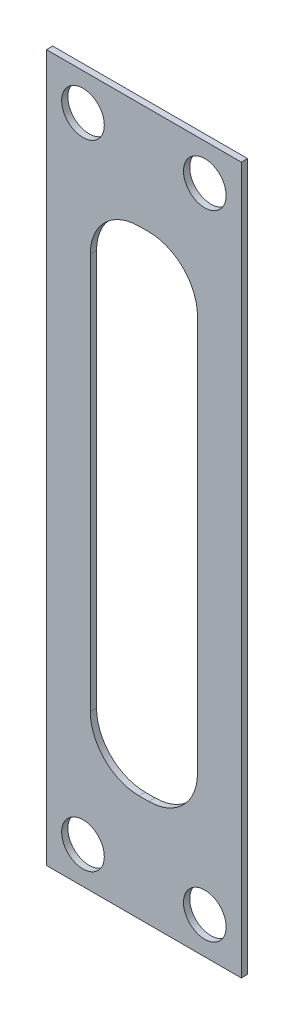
ISO-10303-21;
HEADER;
FILE_DESCRIPTION(('STEP AP214'),'2;1');
FILE_NAME('part.step','',(''),(''),'','','');
FILE_SCHEMA(('AUTOMOTIVE_DESIGN { 1 0 10303 214 1 1 1 1 }'));
ENDSEC;
DATA;
#1=APPLICATION_CONTEXT('core data for automotive mechanical design processes');
#2=APPLICATION_PROTOCOL_DEFINITION('international standard','automotive_design',2000,#1);
#3=PRODUCT_CONTEXT('',#1,'mechanical');
#4=PRODUCT('Part','Part','',(#3));
#5=PRODUCT_RELATED_PRODUCT_CATEGORY('part','',(#4));
#6=PRODUCT_DEFINITION_FORMATION('','',#4);
#7=PRODUCT_DEFINITION_CONTEXT('part definition',#1,'design');
#8=PRODUCT_DEFINITION('design','',#6,#7);
#9=PRODUCT_DEFINITION_SHAPE('','',#8);
#10=(LENGTH_UNIT() NAMED_UNIT(*) SI_UNIT(.MILLI.,.METRE.));
#11=(NAMED_UNIT(*) PLANE_ANGLE_UNIT() SI_UNIT($,.RADIAN.));
#12=(NAMED_UNIT(*) SI_UNIT($,.STERADIAN.) SOLID_ANGLE_UNIT());
#13=UNCERTAINTY_MEASURE_WITH_UNIT(LENGTH_MEASURE(1.E-05),#10,'distance_accuracy_value','');
#14=(GEOMETRIC_REPRESENTATION_CONTEXT(3) GLOBAL_UNCERTAINTY_ASSIGNED_CONTEXT((#13)) GLOBAL_UNIT_ASSIGNED_CONTEXT((#10,
#11,#12)) REPRESENTATION_CONTEXT('',''));
#15=CARTESIAN_POINT('',(0.,0.,0.));
#16=DIRECTION('',(0.,0.,1.));
#17=DIRECTION('',(1.,0.,0.));
#18=AXIS2_PLACEMENT_3D('',#15,#16,#17);
#19=CARTESIAN_POINT('',(-12.7,-46.0375,0.406400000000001));
#20=DIRECTION('',(0.,0.,1.));
#21=DIRECTION('',(1.,0.,0.));
#22=AXIS2_PLACEMENT_3D('',#19,#20,#21);
#23=PLANE('',#22);
#24=CARTESIAN_POINT('',(-7.93750000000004,41.275,0.406400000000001));
#25=DIRECTION('',(0.,0.,1.));
#26=DIRECTION('',(1.,0.,0.));
#27=AXIS2_PLACEMENT_3D('',#24,#25,#26);
#28=CIRCLE('',#27,2.778125);
#29=CARTESIAN_POINT('',(-5.15937500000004,41.275,0.406400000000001));
#30=VERTEX_POINT('',#29);
#31=EDGE_CURVE('E312',#30,#30,#28,.T.);
#32=ORIENTED_EDGE('',*,*,#31,.F.);
#33=EDGE_LOOP('',(#32));
#34=FACE_BOUND('',#33,.T.);
#35=CARTESIAN_POINT('',(7.93750000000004,41.275,0.406400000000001));
#36=DIRECTION('',(0.,0.,1.));
#37=DIRECTION('',(1.,0.,0.));
#38=AXIS2_PLACEMENT_3D('',#35,#36,#37);
#39=CIRCLE('',#38,2.778125);
#40=CARTESIAN_POINT('',(10.715625,41.275,0.406400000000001));
#41=VERTEX_POINT('',#40);
#42=EDGE_CURVE('E316',#41,#41,#39,.T.);
#43=ORIENTED_EDGE('',*,*,#42,.F.);
#44=EDGE_LOOP('',(#43));
#45=FACE_BOUND('',#44,.T.);
#46=CARTESIAN_POINT('',(7.93750000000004,-41.275,0.406400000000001));
#47=DIRECTION('',(0.,0.,1.));
#48=DIRECTION('',(1.,0.,0.));
#49=AXIS2_PLACEMENT_3D('',#46,#47,#48);
#50=CIRCLE('',#49,2.778125);
#51=CARTESIAN_POINT('',(10.715625,-41.275,0.406400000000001));
#52=VERTEX_POINT('',#51);
#53=EDGE_CURVE('E325',#52,#52,#50,.T.);
#54=ORIENTED_EDGE('',*,*,#53,.F.);
#55=EDGE_LOOP('',(#54));
#56=FACE_BOUND('',#55,.T.);
#57=CARTESIAN_POINT('',(-7.93750000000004,-41.275,0.406400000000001));
#58=DIRECTION('',(0.,0.,1.));
#59=DIRECTION('',(1.,0.,0.));
#60=AXIS2_PLACEMENT_3D('',#57,#58,#59);
#61=CIRCLE('',#60,2.778125);
#62=CARTESIAN_POINT('',(-5.15937500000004,-41.275,0.406400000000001));
#63=VERTEX_POINT('',#62);
#64=EDGE_CURVE('E164',#63,#63,#61,.T.);
#65=ORIENTED_EDGE('',*,*,#64,.F.);
#66=EDGE_LOOP('',(#65));
#67=FACE_BOUND('',#66,.T.);
#68=DIRECTION('',(0.,-1.,0.));
#69=VECTOR('',#68,1.);
#70=CARTESIAN_POINT('',(-12.7,46.0375,0.406400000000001));
#71=LINE('',#70,#69);
#72=CARTESIAN_POINT('',(-12.7,46.0375,0.406400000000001));
#73=VERTEX_POINT('',#72);
#74=CARTESIAN_POINT('',(-12.7,-46.0375,0.406400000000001));
#75=VERTEX_POINT('',#74);
#76=EDGE_CURVE('E194',#73,#75,#71,.T.);
#77=ORIENTED_EDGE('',*,*,#76,.T.);
#78=DIRECTION('',(1.,0.,0.));
#79=VECTOR('',#78,1.);
#80=CARTESIAN_POINT('',(-12.7,-46.0375,0.406400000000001));
#81=LINE('',#80,#79);
#82=CARTESIAN_POINT('',(12.7,-46.0375,0.406400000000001));
#83=VERTEX_POINT('',#82);
#84=EDGE_CURVE('E197',#75,#83,#81,.T.);
#85=ORIENTED_EDGE('',*,*,#84,.T.);
#86=DIRECTION('',(0.,1.,0.));
#87=VECTOR('',#86,1.);
#88=CARTESIAN_POINT('',(12.7,46.0375,0.406400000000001));
#89=LINE('',#88,#87);
#90=CARTESIAN_POINT('',(12.7,46.0375,0.406400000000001));
#91=VERTEX_POINT('',#90);
#92=EDGE_CURVE('E200',#83,#91,#89,.T.);
#93=ORIENTED_EDGE('',*,*,#92,.T.);
#94=DIRECTION('',(-1.,0.,0.));
#95=VECTOR('',#94,1.);
#96=CARTESIAN_POINT('',(-12.7,46.0375,0.406400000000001));
#97=LINE('',#96,#95);
#98=EDGE_CURVE('E202',#91,#73,#97,.T.);
#99=ORIENTED_EDGE('',*,*,#98,.T.);
#100=EDGE_LOOP('',(#77,#85,#93,#99));
#101=FACE_BOUND('',#100,.T.);
#102=DIRECTION('',(0.,-1.,0.));
#103=VECTOR('',#102,1.);
#104=CARTESIAN_POINT('',(-6.98500000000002,25.7937,0.406400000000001));
#105=LINE('',#104,#103);
#106=CARTESIAN_POINT('',(-6.98500000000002,25.7937,0.406400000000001));
#107=VERTEX_POINT('',#106);
#108=CARTESIAN_POINT('',(-6.98500000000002,-25.7937,0.406400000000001));
#109=VERTEX_POINT('',#108);
#110=EDGE_CURVE('E135',#107,#109,#105,.T.);
#111=ORIENTED_EDGE('',*,*,#110,.F.);
#112=CARTESIAN_POINT('',(-0.635000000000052,25.7937,0.406400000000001));
#113=DIRECTION('',(0.,0.,1.));
#114=DIRECTION('',(-1.,0.,0.));
#115=AXIS2_PLACEMENT_3D('',#112,#113,#114);
#116=CIRCLE('',#115,6.35);
#117=CARTESIAN_POINT('',(-0.635000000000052,32.1437,0.406400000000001));
#118=VERTEX_POINT('',#117);
#119=EDGE_CURVE('E127',#118,#107,#116,.T.);
#120=ORIENTED_EDGE('',*,*,#119,.F.);
#121=DIRECTION('',(-1.,0.,0.));
#122=VECTOR('',#121,1.);
#123=CARTESIAN_POINT('',(-0.635000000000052,32.1437,0.406400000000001));
#124=LINE('',#123,#122);
#125=CARTESIAN_POINT('',(0.635000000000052,32.1437,0.406400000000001));
#126=VERTEX_POINT('',#125);
#127=EDGE_CURVE('E161',#126,#118,#124,.T.);
#128=ORIENTED_EDGE('',*,*,#127,.F.);
#129=CARTESIAN_POINT('',(0.635000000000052,25.7937,0.406400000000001));
#130=DIRECTION('',(0.,0.,1.));
#131=DIRECTION('',(1.,0.,0.));
#132=AXIS2_PLACEMENT_3D('',#129,#130,#131);
#133=CIRCLE('',#132,6.35);
#134=CARTESIAN_POINT('',(6.98500000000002,25.7937,0.406400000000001));
#135=VERTEX_POINT('',#134);
#136=EDGE_CURVE('E159',#135,#126,#133,.T.);
#137=ORIENTED_EDGE('',*,*,#136,.F.);
#138=DIRECTION('',(0.,1.,0.));
#139=VECTOR('',#138,1.);
#140=CARTESIAN_POINT('',(6.98500000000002,25.7937,0.406400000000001));
#141=LINE('',#140,#139);
#142=CARTESIAN_POINT('',(6.98500000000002,-25.7937,0.406400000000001));
#143=VERTEX_POINT('',#142);
#144=EDGE_CURVE('E157',#143,#135,#141,.T.);
#145=ORIENTED_EDGE('',*,*,#144,.F.);
#146=CARTESIAN_POINT('',(0.635000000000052,-25.7937,0.406400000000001));
#147=DIRECTION('',(0.,0.,1.));
#148=DIRECTION('',(1.,0.,0.));
#149=AXIS2_PLACEMENT_3D('',#146,#147,#148);
#150=CIRCLE('',#149,6.35);
#151=CARTESIAN_POINT('',(0.635000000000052,-32.1437,0.406400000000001));
#152=VERTEX_POINT('',#151);
#153=EDGE_CURVE('E155',#152,#143,#150,.T.);
#154=ORIENTED_EDGE('',*,*,#153,.F.);
#155=DIRECTION('',(1.,0.,0.));
#156=VECTOR('',#155,1.);
#157=CARTESIAN_POINT('',(-0.634999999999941,-32.1437,0.406400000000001));
#158=LINE('',#157,#156);
#159=CARTESIAN_POINT('',(-0.635000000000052,-32.1437,0.406400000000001));
#160=VERTEX_POINT('',#159);
#161=EDGE_CURVE('E150',#160,#152,#158,.T.);
#162=ORIENTED_EDGE('',*,*,#161,.F.);
#163=CARTESIAN_POINT('',(-0.635000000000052,-25.7937,0.406400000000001));
#164=DIRECTION('',(0.,0.,1.));
#165=DIRECTION('',(1.,0.,0.));
#166=AXIS2_PLACEMENT_3D('',#163,#164,#165);
#167=CIRCLE('',#166,6.35);
#168=EDGE_CURVE('E148',#109,#160,#167,.T.);
#169=ORIENTED_EDGE('',*,*,#168,.F.);
#170=EDGE_LOOP('',(#111,#120,#128,#137,#145,#154,#162,#169));
#171=FACE_BOUND('',#170,.T.);
#172=ADVANCED_FACE('F38',(#34,#45,#56,#67,#101,#171),#23,.T.);
#173=CARTESIAN_POINT('',(-12.7,-46.0375,-0.406400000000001));
#174=DIRECTION('',(0.,0.,1.));
#175=DIRECTION('',(1.,0.,0.));
#176=AXIS2_PLACEMENT_3D('',#173,#174,#175);
#177=PLANE('',#176);
#178=CARTESIAN_POINT('',(-7.93750000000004,41.275,-0.406400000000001));
#179=DIRECTION('',(0.,0.,1.));
#180=DIRECTION('',(1.,0.,0.));
#181=AXIS2_PLACEMENT_3D('',#178,#179,#180);
#182=CIRCLE('',#181,2.778125);
#183=CARTESIAN_POINT('',(-5.15937500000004,41.275,-0.406400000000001));
#184=VERTEX_POINT('',#183);
#185=EDGE_CURVE('E310',#184,#184,#182,.T.);
#186=ORIENTED_EDGE('',*,*,#185,.T.);
#187=EDGE_LOOP('',(#186));
#188=FACE_BOUND('',#187,.T.);
#189=CARTESIAN_POINT('',(7.93750000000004,41.275,-0.406400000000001));
#190=DIRECTION('',(0.,0.,1.));
#191=DIRECTION('',(1.,0.,0.));
#192=AXIS2_PLACEMENT_3D('',#189,#190,#191);
#193=CIRCLE('',#192,2.778125);
#194=CARTESIAN_POINT('',(10.715625,41.275,-0.406400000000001));
#195=VERTEX_POINT('',#194);
#196=EDGE_CURVE('E313',#195,#195,#193,.T.);
#197=ORIENTED_EDGE('',*,*,#196,.T.);
#198=EDGE_LOOP('',(#197));
#199=FACE_BOUND('',#198,.T.);
#200=CARTESIAN_POINT('',(7.93750000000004,-41.275,-0.406400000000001));
#201=DIRECTION('',(0.,0.,1.));
#202=DIRECTION('',(1.,0.,0.));
#203=AXIS2_PLACEMENT_3D('',#200,#201,#202);
#204=CIRCLE('',#203,2.778125);
#205=CARTESIAN_POINT('',(10.715625,-41.275,-0.406400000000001));
#206=VERTEX_POINT('',#205);
#207=EDGE_CURVE('E322',#206,#206,#204,.T.);
#208=ORIENTED_EDGE('',*,*,#207,.T.);
#209=EDGE_LOOP('',(#208));
#210=FACE_BOUND('',#209,.T.);
#211=CARTESIAN_POINT('',(-7.93750000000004,-41.275,-0.406400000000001));
#212=DIRECTION('',(0.,0.,1.));
#213=DIRECTION('',(1.,0.,0.));
#214=AXIS2_PLACEMENT_3D('',#211,#212,#213);
#215=CIRCLE('',#214,2.778125);
#216=CARTESIAN_POINT('',(-5.15937500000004,-41.275,-0.406400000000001));
#217=VERTEX_POINT('',#216);
#218=EDGE_CURVE('E328',#217,#217,#215,.T.);
#219=ORIENTED_EDGE('',*,*,#218,.T.);
#220=EDGE_LOOP('',(#219));
#221=FACE_BOUND('',#220,.T.);
#222=DIRECTION('',(0.,-1.,0.));
#223=VECTOR('',#222,1.);
#224=CARTESIAN_POINT('',(-12.7,46.0375,-0.406400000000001));
#225=LINE('',#224,#223);
#226=CARTESIAN_POINT('',(-12.7,46.0375,-0.406400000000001));
#227=VERTEX_POINT('',#226);
#228=CARTESIAN_POINT('',(-12.7,-46.0375,-0.406400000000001));
#229=VERTEX_POINT('',#228);
#230=EDGE_CURVE('E143',#227,#229,#225,.T.);
#231=ORIENTED_EDGE('',*,*,#230,.F.);
#232=DIRECTION('',(-1.,0.,0.));
#233=VECTOR('',#232,1.);
#234=CARTESIAN_POINT('',(-12.7,46.0375,-0.406400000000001));
#235=LINE('',#234,#233);
#236=CARTESIAN_POINT('',(12.7,46.0375,-0.406400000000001));
#237=VERTEX_POINT('',#236);
#238=EDGE_CURVE('E198',#237,#227,#235,.T.);
#239=ORIENTED_EDGE('',*,*,#238,.F.);
#240=DIRECTION('',(0.,1.,0.));
#241=VECTOR('',#240,1.);
#242=CARTESIAN_POINT('',(12.7,46.0375,-0.406400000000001));
#243=LINE('',#242,#241);
#244=CARTESIAN_POINT('',(12.7,-46.0375,-0.406400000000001));
#245=VERTEX_POINT('',#244);
#246=EDGE_CURVE('E209',#245,#237,#243,.T.);
#247=ORIENTED_EDGE('',*,*,#246,.F.);
#248=DIRECTION('',(1.,0.,0.));
#249=VECTOR('',#248,1.);
#250=CARTESIAN_POINT('',(-12.7,-46.0375,-0.406400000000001));
#251=LINE('',#250,#249);
#252=EDGE_CURVE('E207',#229,#245,#251,.T.);
#253=ORIENTED_EDGE('',*,*,#252,.F.);
#254=EDGE_LOOP('',(#231,#239,#247,#253));
#255=FACE_BOUND('',#254,.T.);
#256=CARTESIAN_POINT('',(-0.635000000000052,25.7937,-0.406400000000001));
#257=DIRECTION('',(0.,0.,1.));
#258=DIRECTION('',(-1.,0.,0.));
#259=AXIS2_PLACEMENT_3D('',#256,#257,#258);
#260=CIRCLE('',#259,6.35);
#261=CARTESIAN_POINT('',(-0.635000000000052,32.1437,-0.406400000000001));
#262=VERTEX_POINT('',#261);
#263=CARTESIAN_POINT('',(-6.98500000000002,25.7937,-0.406400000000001));
#264=VERTEX_POINT('',#263);
#265=EDGE_CURVE('E61',#262,#264,#260,.T.);
#266=ORIENTED_EDGE('',*,*,#265,.T.);
#267=DIRECTION('',(0.,-1.,0.));
#268=VECTOR('',#267,1.);
#269=CARTESIAN_POINT('',(-6.98500000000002,25.7937,-0.406400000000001));
#270=LINE('',#269,#268);
#271=CARTESIAN_POINT('',(-6.98500000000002,-25.7937,-0.406400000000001));
#272=VERTEX_POINT('',#271);
#273=EDGE_CURVE('E142',#264,#272,#270,.T.);
#274=ORIENTED_EDGE('',*,*,#273,.T.);
#275=CARTESIAN_POINT('',(-0.635000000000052,-25.7937,-0.406400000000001));
#276=DIRECTION('',(0.,0.,1.));
#277=DIRECTION('',(1.,0.,0.));
#278=AXIS2_PLACEMENT_3D('',#275,#276,#277);
#279=CIRCLE('',#278,6.35);
#280=CARTESIAN_POINT('',(-0.635000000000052,-32.1437,-0.406400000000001));
#281=VERTEX_POINT('',#280);
#282=EDGE_CURVE('E166',#272,#281,#279,.T.);
#283=ORIENTED_EDGE('',*,*,#282,.T.);
#284=DIRECTION('',(1.,0.,0.));
#285=VECTOR('',#284,1.);
#286=CARTESIAN_POINT('',(-0.634999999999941,-32.1437,-0.406400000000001));
#287=LINE('',#286,#285);
#288=CARTESIAN_POINT('',(0.635000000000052,-32.1437,-0.406400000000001));
#289=VERTEX_POINT('',#288);
#290=EDGE_CURVE('E169',#281,#289,#287,.T.);
#291=ORIENTED_EDGE('',*,*,#290,.T.);
#292=CARTESIAN_POINT('',(0.635000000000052,-25.7937,-0.406400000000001));
#293=DIRECTION('',(0.,0.,1.));
#294=DIRECTION('',(1.,0.,0.));
#295=AXIS2_PLACEMENT_3D('',#292,#293,#294);
#296=CIRCLE('',#295,6.35);
#297=CARTESIAN_POINT('',(6.98500000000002,-25.7937,-0.406400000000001));
#298=VERTEX_POINT('',#297);
#299=EDGE_CURVE('E172',#289,#298,#296,.T.);
#300=ORIENTED_EDGE('',*,*,#299,.T.);
#301=DIRECTION('',(0.,1.,0.));
#302=VECTOR('',#301,1.);
#303=CARTESIAN_POINT('',(6.98500000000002,25.7937,-0.406400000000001));
#304=LINE('',#303,#302);
#305=CARTESIAN_POINT('',(6.98500000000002,25.7937,-0.406400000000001));
#306=VERTEX_POINT('',#305);
#307=EDGE_CURVE('E175',#298,#306,#304,.T.);
#308=ORIENTED_EDGE('',*,*,#307,.T.);
#309=CARTESIAN_POINT('',(0.635000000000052,25.7937,-0.406400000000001));
#310=DIRECTION('',(0.,0.,1.));
#311=DIRECTION('',(1.,0.,0.));
#312=AXIS2_PLACEMENT_3D('',#309,#310,#311);
#313=CIRCLE('',#312,6.35);
#314=CARTESIAN_POINT('',(0.635000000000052,32.1437,-0.406400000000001));
#315=VERTEX_POINT('',#314);
#316=EDGE_CURVE('E178',#306,#315,#313,.T.);
#317=ORIENTED_EDGE('',*,*,#316,.T.);
#318=DIRECTION('',(-1.,0.,0.));
#319=VECTOR('',#318,1.);
#320=CARTESIAN_POINT('',(-0.635000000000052,32.1437,-0.406400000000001));
#321=LINE('',#320,#319);
#322=EDGE_CURVE('E136',#315,#262,#321,.T.);
#323=ORIENTED_EDGE('',*,*,#322,.T.);
#324=EDGE_LOOP('',(#266,#274,#283,#291,#300,#308,#317,#323));
#325=FACE_BOUND('',#324,.T.);
#326=ADVANCED_FACE('F227',(#188,#199,#210,#221,#255,#325),#177,.F.);
#327=CARTESIAN_POINT('',(-12.7,46.0375,0.406400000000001));
#328=DIRECTION('',(1.,0.,0.));
#329=DIRECTION('',(0.,1.,0.));
#330=AXIS2_PLACEMENT_3D('',#327,#328,#329);
#331=PLANE('',#330);
#332=ORIENTED_EDGE('',*,*,#230,.T.);
#333=DIRECTION('',(0.,0.,-1.));
#334=VECTOR('',#333,1.);
#335=CARTESIAN_POINT('',(-12.7,-46.0375,0.406400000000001));
#336=LINE('',#335,#334);
#337=EDGE_CURVE('E11',#75,#229,#336,.T.);
#338=ORIENTED_EDGE('',*,*,#337,.F.);
#339=ORIENTED_EDGE('',*,*,#76,.F.);
#340=DIRECTION('',(0.,0.,-1.));
#341=VECTOR('',#340,1.);
#342=CARTESIAN_POINT('',(-12.7,46.0375,0.406400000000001));
#343=LINE('',#342,#341);
#344=EDGE_CURVE('E204',#73,#227,#343,.T.);
#345=ORIENTED_EDGE('',*,*,#344,.T.);
#346=EDGE_LOOP('',(#332,#338,#339,#345));
#347=FACE_BOUND('',#346,.T.);
#348=ADVANCED_FACE('F40',(#347),#331,.F.);
#349=CARTESIAN_POINT('',(-12.7,-46.0375,0.406400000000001));
#350=DIRECTION('',(0.,1.,0.));
#351=DIRECTION('',(0.,0.,1.));
#352=AXIS2_PLACEMENT_3D('',#349,#350,#351);
#353=PLANE('',#352);
#354=ORIENTED_EDGE('',*,*,#252,.T.);
#355=DIRECTION('',(0.,0.,-1.));
#356=VECTOR('',#355,1.);
#357=CARTESIAN_POINT('',(12.7,-46.0375,0.406400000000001));
#358=LINE('',#357,#356);
#359=EDGE_CURVE('E46',#83,#245,#358,.T.);
#360=ORIENTED_EDGE('',*,*,#359,.F.);
#361=ORIENTED_EDGE('',*,*,#84,.F.);
#362=ORIENTED_EDGE('',*,*,#337,.T.);
#363=EDGE_LOOP('',(#354,#360,#361,#362));
#364=FACE_BOUND('',#363,.T.);
#365=ADVANCED_FACE('F237',(#364),#353,.F.);
#366=CARTESIAN_POINT('',(12.7,46.0375,0.406400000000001));
#367=DIRECTION('',(-1.,0.,0.));
#368=DIRECTION('',(0.,-1.,0.));
#369=AXIS2_PLACEMENT_3D('',#366,#367,#368);
#370=PLANE('',#369);
#371=ORIENTED_EDGE('',*,*,#246,.T.);
#372=DIRECTION('',(0.,0.,-1.));
#373=VECTOR('',#372,1.);
#374=CARTESIAN_POINT('',(12.7,46.0375,0.406400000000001));
#375=LINE('',#374,#373);
#376=EDGE_CURVE('E214',#91,#237,#375,.T.);
#377=ORIENTED_EDGE('',*,*,#376,.F.);
#378=ORIENTED_EDGE('',*,*,#92,.F.);
#379=ORIENTED_EDGE('',*,*,#359,.T.);
#380=EDGE_LOOP('',(#371,#377,#378,#379));
#381=FACE_BOUND('',#380,.T.);
#382=ADVANCED_FACE('F221',(#381),#370,.F.);
#383=CARTESIAN_POINT('',(-12.7,46.0375,0.406400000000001));
#384=DIRECTION('',(0.,-1.,0.));
#385=DIRECTION('',(0.,0.,-1.));
#386=AXIS2_PLACEMENT_3D('',#383,#384,#385);
#387=PLANE('',#386);
#388=ORIENTED_EDGE('',*,*,#238,.T.);
#389=ORIENTED_EDGE('',*,*,#344,.F.);
#390=ORIENTED_EDGE('',*,*,#98,.F.);
#391=ORIENTED_EDGE('',*,*,#376,.T.);
#392=EDGE_LOOP('',(#388,#389,#390,#391));
#393=FACE_BOUND('',#392,.T.);
#394=ADVANCED_FACE('F231',(#393),#387,.F.);
#395=CARTESIAN_POINT('',(-0.635000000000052,25.7937,0.406400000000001));
#396=DIRECTION('',(0.,0.,-1.));
#397=DIRECTION('',(-1.,0.,0.));
#398=AXIS2_PLACEMENT_3D('',#395,#396,#397);
#399=CYLINDRICAL_SURFACE('',#398,6.35);
#400=ORIENTED_EDGE('',*,*,#265,.F.);
#401=DIRECTION('',(0.,0.,-1.));
#402=VECTOR('',#401,1.);
#403=CARTESIAN_POINT('',(-0.635000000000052,32.1437,0.406400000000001));
#404=LINE('',#403,#402);
#405=EDGE_CURVE('E131',#118,#262,#404,.T.);
#406=ORIENTED_EDGE('',*,*,#405,.F.);
#407=ORIENTED_EDGE('',*,*,#119,.T.);
#408=DIRECTION('',(0.,0.,-1.));
#409=VECTOR('',#408,1.);
#410=CARTESIAN_POINT('',(-6.98500000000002,25.7937,0.406400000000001));
#411=LINE('',#410,#409);
#412=EDGE_CURVE('E130',#107,#264,#411,.T.);
#413=ORIENTED_EDGE('',*,*,#412,.T.);
#414=EDGE_LOOP('',(#400,#406,#407,#413));
#415=FACE_BOUND('',#414,.T.);
#416=ADVANCED_FACE('F129',(#415),#399,.F.);
#417=CARTESIAN_POINT('',(-6.98500000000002,25.7937,0.406400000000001));
#418=DIRECTION('',(1.,0.,0.));
#419=DIRECTION('',(0.,1.,0.));
#420=AXIS2_PLACEMENT_3D('',#417,#418,#419);
#421=PLANE('',#420);
#422=ORIENTED_EDGE('',*,*,#273,.F.);
#423=ORIENTED_EDGE('',*,*,#412,.F.);
#424=ORIENTED_EDGE('',*,*,#110,.T.);
#425=DIRECTION('',(0.,0.,-1.));
#426=VECTOR('',#425,1.);
#427=CARTESIAN_POINT('',(-6.98500000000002,-25.7937,0.406400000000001));
#428=LINE('',#427,#426);
#429=EDGE_CURVE('E144',#109,#272,#428,.T.);
#430=ORIENTED_EDGE('',*,*,#429,.T.);
#431=EDGE_LOOP('',(#422,#423,#424,#430));
#432=FACE_BOUND('',#431,.T.);
#433=ADVANCED_FACE('F139',(#432),#421,.T.);
#434=CARTESIAN_POINT('',(-0.635000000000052,-25.7937,0.406400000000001));
#435=DIRECTION('',(0.,0.,-1.));
#436=DIRECTION('',(-1.,0.,0.));
#437=AXIS2_PLACEMENT_3D('',#434,#435,#436);
#438=CYLINDRICAL_SURFACE('',#437,6.35);
#439=ORIENTED_EDGE('',*,*,#282,.F.);
#440=ORIENTED_EDGE('',*,*,#429,.F.);
#441=ORIENTED_EDGE('',*,*,#168,.T.);
#442=DIRECTION('',(0.,0.,-1.));
#443=VECTOR('',#442,1.);
#444=CARTESIAN_POINT('',(-0.635000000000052,-32.1437,0.406400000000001));
#445=LINE('',#444,#443);
#446=EDGE_CURVE('E191',#160,#281,#445,.T.);
#447=ORIENTED_EDGE('',*,*,#446,.T.);
#448=EDGE_LOOP('',(#439,#440,#441,#447));
#449=FACE_BOUND('',#448,.T.);
#450=ADVANCED_FACE('F264',(#449),#438,.F.);
#451=CARTESIAN_POINT('',(-0.634999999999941,-32.1437,0.406400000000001));
#452=DIRECTION('',(0.,1.,0.));
#453=DIRECTION('',(0.,0.,1.));
#454=AXIS2_PLACEMENT_3D('',#451,#452,#453);
#455=PLANE('',#454);
#456=ORIENTED_EDGE('',*,*,#290,.F.);
#457=ORIENTED_EDGE('',*,*,#446,.F.);
#458=ORIENTED_EDGE('',*,*,#161,.T.);
#459=DIRECTION('',(0.,0.,-1.));
#460=VECTOR('',#459,1.);
#461=CARTESIAN_POINT('',(0.635000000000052,-32.1437,0.406400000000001));
#462=LINE('',#461,#460);
#463=EDGE_CURVE('E189',#152,#289,#462,.T.);
#464=ORIENTED_EDGE('',*,*,#463,.T.);
#465=EDGE_LOOP('',(#456,#457,#458,#464));
#466=FACE_BOUND('',#465,.T.);
#467=ADVANCED_FACE('F268',(#466),#455,.T.);
#468=CARTESIAN_POINT('',(0.635000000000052,-25.7937,0.406400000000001));
#469=DIRECTION('',(0.,0.,-1.));
#470=DIRECTION('',(-1.,0.,0.));
#471=AXIS2_PLACEMENT_3D('',#468,#469,#470);
#472=CYLINDRICAL_SURFACE('',#471,6.35);
#473=ORIENTED_EDGE('',*,*,#299,.F.);
#474=ORIENTED_EDGE('',*,*,#463,.F.);
#475=ORIENTED_EDGE('',*,*,#153,.T.);
#476=DIRECTION('',(0.,0.,-1.));
#477=VECTOR('',#476,1.);
#478=CARTESIAN_POINT('',(6.98500000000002,-25.7937,0.406400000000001));
#479=LINE('',#478,#477);
#480=EDGE_CURVE('E187',#143,#298,#479,.T.);
#481=ORIENTED_EDGE('',*,*,#480,.T.);
#482=EDGE_LOOP('',(#473,#474,#475,#481));
#483=FACE_BOUND('',#482,.T.);
#484=ADVANCED_FACE('F274',(#483),#472,.F.);
#485=CARTESIAN_POINT('',(6.98500000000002,25.7937,0.406400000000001));
#486=DIRECTION('',(-1.,0.,0.));
#487=DIRECTION('',(0.,-1.,0.));
#488=AXIS2_PLACEMENT_3D('',#485,#486,#487);
#489=PLANE('',#488);
#490=ORIENTED_EDGE('',*,*,#307,.F.);
#491=ORIENTED_EDGE('',*,*,#480,.F.);
#492=ORIENTED_EDGE('',*,*,#144,.T.);
#493=DIRECTION('',(0.,0.,-1.));
#494=VECTOR('',#493,1.);
#495=CARTESIAN_POINT('',(6.98500000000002,25.7937,0.406400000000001));
#496=LINE('',#495,#494);
#497=EDGE_CURVE('E185',#135,#306,#496,.T.);
#498=ORIENTED_EDGE('',*,*,#497,.T.);
#499=EDGE_LOOP('',(#490,#491,#492,#498));
#500=FACE_BOUND('',#499,.T.);
#501=ADVANCED_FACE('F278',(#500),#489,.T.);
#502=CARTESIAN_POINT('',(0.635000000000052,25.7937,0.406400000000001));
#503=DIRECTION('',(0.,0.,-1.));
#504=DIRECTION('',(-1.,0.,0.));
#505=AXIS2_PLACEMENT_3D('',#502,#503,#504);
#506=CYLINDRICAL_SURFACE('',#505,6.35);
#507=ORIENTED_EDGE('',*,*,#316,.F.);
#508=ORIENTED_EDGE('',*,*,#497,.F.);
#509=ORIENTED_EDGE('',*,*,#136,.T.);
#510=DIRECTION('',(0.,0.,-1.));
#511=VECTOR('',#510,1.);
#512=CARTESIAN_POINT('',(0.635000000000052,32.1437,0.406400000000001));
#513=LINE('',#512,#511);
#514=EDGE_CURVE('E53',#126,#315,#513,.T.);
#515=ORIENTED_EDGE('',*,*,#514,.T.);
#516=EDGE_LOOP('',(#507,#508,#509,#515));
#517=FACE_BOUND('',#516,.T.);
#518=ADVANCED_FACE('F282',(#517),#506,.F.);
#519=CARTESIAN_POINT('',(-0.635000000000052,32.1437,0.406400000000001));
#520=DIRECTION('',(0.,-1.,0.));
#521=DIRECTION('',(0.,0.,-1.));
#522=AXIS2_PLACEMENT_3D('',#519,#520,#521);
#523=PLANE('',#522);
#524=ORIENTED_EDGE('',*,*,#322,.F.);
#525=ORIENTED_EDGE('',*,*,#514,.F.);
#526=ORIENTED_EDGE('',*,*,#127,.T.);
#527=ORIENTED_EDGE('',*,*,#405,.T.);
#528=EDGE_LOOP('',(#524,#525,#526,#527));
#529=FACE_BOUND('',#528,.T.);
#530=ADVANCED_FACE('F286',(#529),#523,.T.);
#531=CARTESIAN_POINT('',(-7.93750000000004,-41.275,0.406400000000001));
#532=DIRECTION('',(0.,0.,1.));
#533=DIRECTION('',(1.,0.,0.));
#534=AXIS2_PLACEMENT_3D('',#531,#532,#533);
#535=CYLINDRICAL_SURFACE('',#534,2.778125);
#536=ORIENTED_EDGE('',*,*,#218,.F.);
#537=EDGE_LOOP('',(#536));
#538=FACE_BOUND('',#537,.T.);
#539=ORIENTED_EDGE('',*,*,#64,.T.);
#540=EDGE_LOOP('',(#539));
#541=FACE_BOUND('',#540,.T.);
#542=ADVANCED_FACE('F290',(#538,#541),#535,.F.);
#543=CARTESIAN_POINT('',(7.93750000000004,-41.275,0.406400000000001));
#544=DIRECTION('',(0.,0.,1.));
#545=DIRECTION('',(1.,0.,0.));
#546=AXIS2_PLACEMENT_3D('',#543,#544,#545);
#547=CYLINDRICAL_SURFACE('',#546,2.778125);
#548=ORIENTED_EDGE('',*,*,#207,.F.);
#549=EDGE_LOOP('',(#548));
#550=FACE_BOUND('',#549,.T.);
#551=ORIENTED_EDGE('',*,*,#53,.T.);
#552=EDGE_LOOP('',(#551));
#553=FACE_BOUND('',#552,.T.);
#554=ADVANCED_FACE('F293',(#550,#553),#547,.F.);
#555=CARTESIAN_POINT('',(7.93750000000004,41.275,0.406400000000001));
#556=DIRECTION('',(0.,0.,1.));
#557=DIRECTION('',(1.,0.,0.));
#558=AXIS2_PLACEMENT_3D('',#555,#556,#557);
#559=CYLINDRICAL_SURFACE('',#558,2.778125);
#560=ORIENTED_EDGE('',*,*,#196,.F.);
#561=EDGE_LOOP('',(#560));
#562=FACE_BOUND('',#561,.T.);
#563=ORIENTED_EDGE('',*,*,#42,.T.);
#564=EDGE_LOOP('',(#563));
#565=FACE_BOUND('',#564,.T.);
#566=ADVANCED_FACE('F297',(#562,#565),#559,.F.);
#567=CARTESIAN_POINT('',(-7.93750000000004,41.275,0.406400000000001));
#568=DIRECTION('',(0.,0.,1.));
#569=DIRECTION('',(1.,0.,0.));
#570=AXIS2_PLACEMENT_3D('',#567,#568,#569);
#571=CYLINDRICAL_SURFACE('',#570,2.778125);
#572=ORIENTED_EDGE('',*,*,#185,.F.);
#573=EDGE_LOOP('',(#572));
#574=FACE_BOUND('',#573,.T.);
#575=ORIENTED_EDGE('',*,*,#31,.T.);
#576=EDGE_LOOP('',(#575));
#577=FACE_BOUND('',#576,.T.);
#578=ADVANCED_FACE('F301',(#574,#577),#571,.F.);
#579=CLOSED_SHELL('',(#172,#326,#348,#365,#382,#394,#416,#433,#450,#467,#484,#501,#518,#530,
#542,#554,#566,#578));
#580=MANIFOLD_SOLID_BREP('B2',#579);
#581=ADVANCED_BREP_SHAPE_REPRESENTATION('',(#18,#580),#14);
#582=SHAPE_DEFINITION_REPRESENTATION(#9,#581);
ENDSEC;
END-ISO-10303-21;
